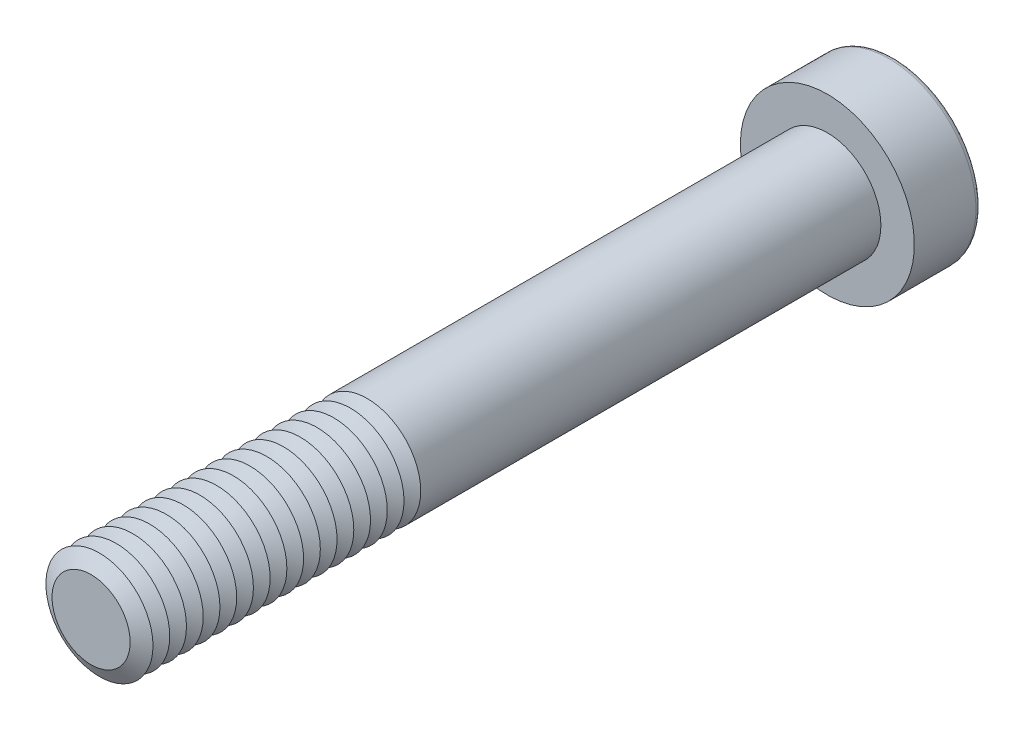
from build123d import *

# Parameters (mm, degrees)
SKETCH1_R           = 4
BOSS_EXTRUDE1_DEPTH = 55
SKETCH2_R           = 6.5
BOSS_EXTRUDE2_DEPTH = 5
CUT_EXTRUDE1_DEPTH  = 3.75
FILLET1_R           = 0.4
LPATTERN1_COUNT     = 17
LPATTERN1_PITCH     = 1.25


with BuildPart() as part:
    # Sketch1 → Boss-Extrude1 (new body)
    with BuildSketch(Plane.XY):
        Circle(SKETCH1_R)
    extrude(amount=BOSS_EXTRUDE1_DEPTH)

    # Sketch2 → Boss-Extrude2 (add)
    with BuildSketch(Plane(origin=(0, 0, 0), x_dir=(-1, 0, 0), z_dir=(0, 0, -1))):
        Circle(SKETCH2_R)
    extrude(amount=BOSS_EXTRUDE2_DEPTH)

    # Sketch3 → Cut-Extrude1 (cut)
    with BuildSketch(Plane(origin=(0, 0, -5), x_dir=(-1, 0, 0), z_dir=(0, 0, -1))):
        Polygon((-1.443375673, 2.5), (-2.886751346, 0), (-1.443375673, -2.5), (1.443375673, -2.5), (2.886751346, 0), (1.443375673, 2.5), align=None)
    extrude(amount=-CUT_EXTRUDE1_DEPTH, mode=Mode.SUBTRACT)

    # Fillet1
    fillet1_edges = [part.edges().sort_by_distance(p)[0] for p in [
        (6.5, 0, -5),
    ]]
    fillet(fillet1_edges, radius=FILLET1_R)

    # Cut-Extrude2 cone 1 section (on through the dimple's axis) → Cut-Extrude2 (revolve, cut)
    with BuildSketch(Plane(origin=(0, 0, -1.25), x_dir=(0, 1, 0), z_dir=(1, 0, 0))):
        Polygon((0, 0), (2.5, 0), (0, 1.443375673), align=None)
    revolve(axis=Axis((0, 0, -1.25), (0, 0, 1)), mode=Mode.SUBTRACT)

    # Cut-Extrude3 cone 1 section (on through the dimple's axis) → Cut-Extrude3 (revolve, cut)
    with BuildSketch(Plane(origin=(0, 0, -5), x_dir=(0, 1, 0), z_dir=(1, 0, 0))):
        Polygon((0, 0), (2.886751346, 0), (0, 0.773502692), align=None)
    revolve(axis=Axis((0, 0, -5), (0, 0, 1)), mode=Mode.SUBTRACT)

    # Sketch7 → Cut-Revolve1 (revolve, cut)
    with BuildSketch(Plane(origin=(0, 0, 0), x_dir=(0, 0, -1), z_dir=(1, 0, 0)), mode=Mode.PRIVATE) as cut_revolve1_sk:
        Polygon((-55, 2.917468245), (-54.375, 4), (-55.625, 4), align=None)
    cut_revolve1 = revolve(cut_revolve1_sk.sketch.rotate(Axis((0, 0, 55), (0, 0, -1)), 90), axis=Axis((0, 0, 55), (0, 0, -1)), mode=Mode.SUBTRACT)

    # LPattern1: Cut-Revolve1 ×17
    with Locations(*[(0, 0, -i * LPATTERN1_PITCH) for i in range(1, LPATTERN1_COUNT)]):
        add(cut_revolve1, mode=Mode.SUBTRACT)


solid = part.part
